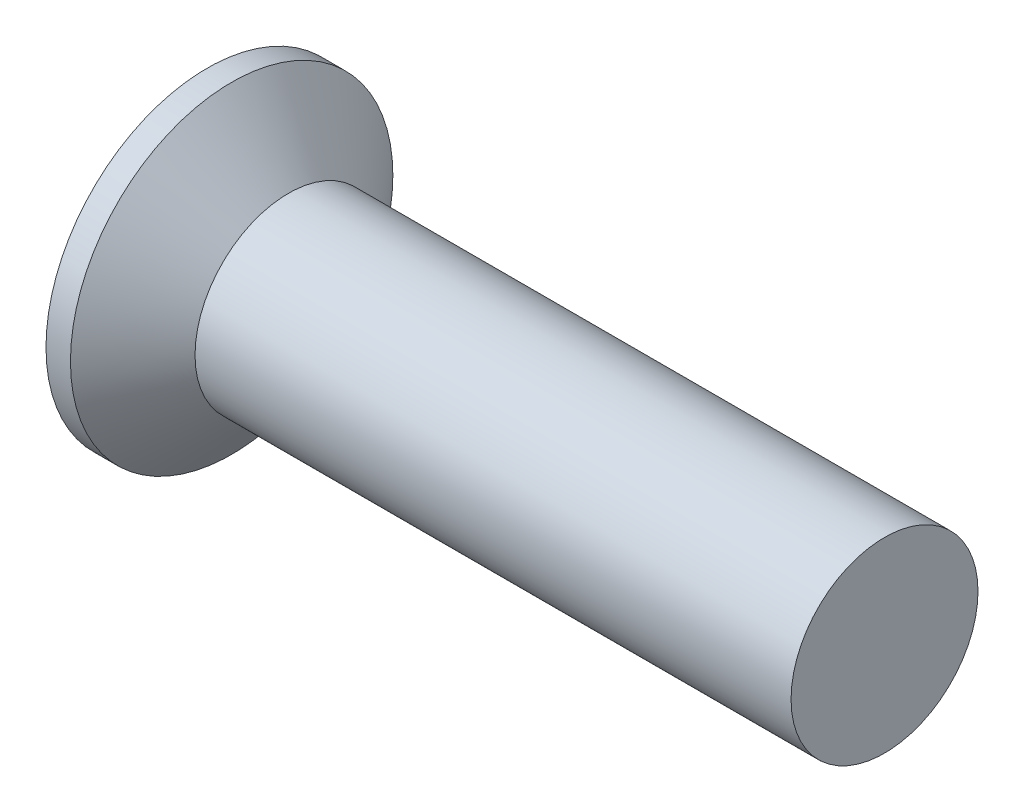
from build123d import *

# Parameters (mm, degrees)
CIRPATTERN1_COUNT = 2
CIRPATTERN1_ANGLE = 90


with BuildPart() as part:
    # BodySke → Base-Revolve (revolve)
    with BuildSketch(Plane.XY, mode=Mode.PRIVATE) as base_revolve_sk:
        Polygon((0, 0), (0, 3.0226), (0.458343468, 3.0226), (1.524, 1.7526), (12.7, 1.7526), (12.7, 0), align=None)
    revolve(base_revolve_sk.sketch.rotate(Axis((-6.35, 0, 0), (1, 0, 0)), 90), axis=Axis((-6.35, 0, 0), (1, 0, 0)))

    # Sketch3 → Cross section 0
    with BuildSketch(Plane.ZY):
        with BuildLine():
            Line((-0.4191, 2.0574), (0.4191, 2.0574))
            Line((0.4191, 2.0574), (0.4191, -2.0574))
            Line((0.4191, -2.0574), (-0.4191, -2.0574))
            Line((-0.4191, -2.0574), (-0.4191, 2.0574))
        make_face()
    # Sketch4 → Cross section 1
    with BuildSketch(Plane.ZY.offset(-2.6924)):
        with BuildLine():
            Line((-0.20955, 0.20955), (0.20955, 0.20955))
            Line((0.20955, 0.20955), (0.20955, -0.20955))
            Line((0.20955, -0.20955), (-0.20955, -0.20955))
            Line((-0.20955, -0.20955), (-0.20955, 0.20955))
        make_face()
    cross = loft(mode=Mode.SUBTRACT)

    # CirPattern1: Cross ×2 about axis
    cirpattern1_axis = Axis((0, 0, 0), (1, 0, 0))
    for i in range(1, CIRPATTERN1_COUNT):
        add(cross.rotate(cirpattern1_axis, i * CIRPATTERN1_ANGLE / (CIRPATTERN1_COUNT - 1)), mode=Mode.SUBTRACT)


solid = part.part
